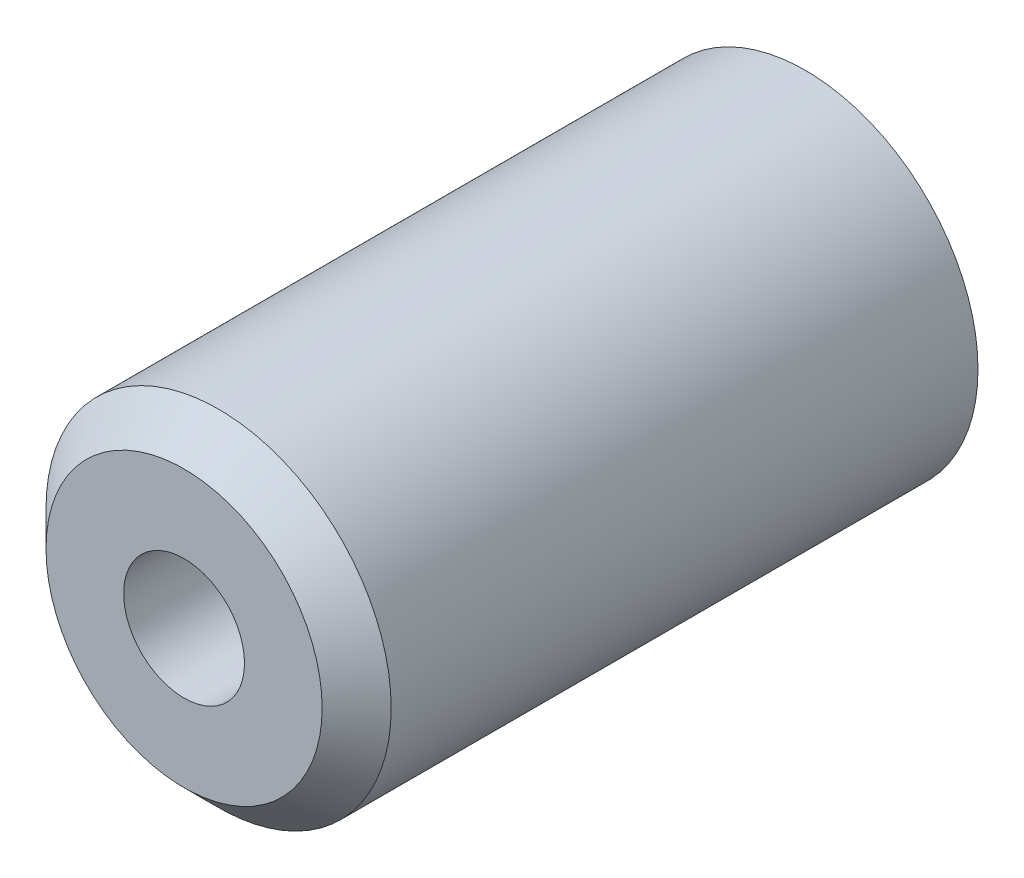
ISO-10303-21;
HEADER;
FILE_DESCRIPTION(('STEP AP214'),'2;1');
FILE_NAME('part.step','',(''),(''),'','','');
FILE_SCHEMA(('AUTOMOTIVE_DESIGN { 1 0 10303 214 1 1 1 1 }'));
ENDSEC;
DATA;
#1=APPLICATION_CONTEXT('core data for automotive mechanical design processes');
#2=APPLICATION_PROTOCOL_DEFINITION('international standard','automotive_design',2000,#1);
#3=PRODUCT_CONTEXT('',#1,'mechanical');
#4=PRODUCT('Part','Part','',(#3));
#5=PRODUCT_RELATED_PRODUCT_CATEGORY('part','',(#4));
#6=PRODUCT_DEFINITION_FORMATION('','',#4);
#7=PRODUCT_DEFINITION_CONTEXT('part definition',#1,'design');
#8=PRODUCT_DEFINITION('design','',#6,#7);
#9=PRODUCT_DEFINITION_SHAPE('','',#8);
#10=(LENGTH_UNIT() NAMED_UNIT(*) SI_UNIT(.MILLI.,.METRE.));
#11=(NAMED_UNIT(*) PLANE_ANGLE_UNIT() SI_UNIT($,.RADIAN.));
#12=(NAMED_UNIT(*) SI_UNIT($,.STERADIAN.) SOLID_ANGLE_UNIT());
#13=UNCERTAINTY_MEASURE_WITH_UNIT(LENGTH_MEASURE(1.E-05),#10,'distance_accuracy_value','');
#14=(GEOMETRIC_REPRESENTATION_CONTEXT(3) GLOBAL_UNCERTAINTY_ASSIGNED_CONTEXT((#13)) GLOBAL_UNIT_ASSIGNED_CONTEXT((#10,
#11,#12)) REPRESENTATION_CONTEXT('',''));
#15=CARTESIAN_POINT('',(0.,0.,0.));
#16=DIRECTION('',(0.,0.,1.));
#17=DIRECTION('',(1.,0.,0.));
#18=AXIS2_PLACEMENT_3D('',#15,#16,#17);
#19=CARTESIAN_POINT('',(0.,0.,18.));
#20=DIRECTION('',(0.,0.,1.));
#21=DIRECTION('',(1.,0.,0.));
#22=AXIS2_PLACEMENT_3D('',#19,#20,#21);
#23=PLANE('',#22);
#24=CARTESIAN_POINT('',(0.,0.,18.));
#25=DIRECTION('',(0.,0.,1.));
#26=DIRECTION('',(1.,0.,0.));
#27=AXIS2_PLACEMENT_3D('',#24,#25,#26);
#28=CIRCLE('',#27,4.);
#29=CARTESIAN_POINT('',(4.,0.,18.));
#30=VERTEX_POINT('',#29);
#31=EDGE_CURVE('E35',#30,#30,#28,.T.);
#32=ORIENTED_EDGE('',*,*,#31,.T.);
#33=EDGE_LOOP('',(#32));
#34=FACE_BOUND('',#33,.T.);
#35=CARTESIAN_POINT('',(0.,0.,18.));
#36=DIRECTION('',(0.,0.,1.));
#37=DIRECTION('',(1.,0.,0.));
#38=AXIS2_PLACEMENT_3D('',#35,#36,#37);
#39=CIRCLE('',#38,1.75);
#40=CARTESIAN_POINT('',(1.75,0.,18.));
#41=VERTEX_POINT('',#40);
#42=EDGE_CURVE('E43',#41,#41,#39,.T.);
#43=ORIENTED_EDGE('',*,*,#42,.F.);
#44=EDGE_LOOP('',(#43));
#45=FACE_BOUND('',#44,.T.);
#46=ADVANCED_FACE('F28',(#34,#45),#23,.T.);
#47=CARTESIAN_POINT('',(0.,0.,0.));
#48=DIRECTION('',(0.,0.,1.));
#49=DIRECTION('',(1.,0.,0.));
#50=AXIS2_PLACEMENT_3D('',#47,#48,#49);
#51=PLANE('',#50);
#52=CARTESIAN_POINT('',(0.,0.,0.));
#53=DIRECTION('',(0.,0.,1.));
#54=DIRECTION('',(1.,0.,0.));
#55=AXIS2_PLACEMENT_3D('',#52,#53,#54);
#56=CIRCLE('',#55,5.);
#57=CARTESIAN_POINT('',(5.,0.,0.));
#58=VERTEX_POINT('',#57);
#59=EDGE_CURVE('E39',#58,#58,#56,.T.);
#60=ORIENTED_EDGE('',*,*,#59,.F.);
#61=EDGE_LOOP('',(#60));
#62=FACE_BOUND('',#61,.T.);
#63=CARTESIAN_POINT('',(0.,0.,0.));
#64=DIRECTION('',(0.,0.,1.));
#65=DIRECTION('',(1.,0.,0.));
#66=AXIS2_PLACEMENT_3D('',#63,#64,#65);
#67=CIRCLE('',#66,1.75);
#68=CARTESIAN_POINT('',(1.75,0.,0.));
#69=VERTEX_POINT('',#68);
#70=EDGE_CURVE('E46',#69,#69,#67,.T.);
#71=ORIENTED_EDGE('',*,*,#70,.T.);
#72=EDGE_LOOP('',(#71));
#73=FACE_BOUND('',#72,.T.);
#74=ADVANCED_FACE('F56',(#62,#73),#51,.F.);
#75=CARTESIAN_POINT('',(0.,0.,18.));
#76=DIRECTION('',(0.,0.,-1.));
#77=DIRECTION('',(-1.,0.,0.));
#78=AXIS2_PLACEMENT_3D('',#75,#76,#77);
#79=CYLINDRICAL_SURFACE('',#78,5.);
#80=CARTESIAN_POINT('',(0.,0.,17.));
#81=DIRECTION('',(0.,0.,1.));
#82=DIRECTION('',(1.,0.,0.));
#83=AXIS2_PLACEMENT_3D('',#80,#81,#82);
#84=CIRCLE('',#83,5.);
#85=CARTESIAN_POINT('',(5.,0.,17.));
#86=VERTEX_POINT('',#85);
#87=EDGE_CURVE('E10',#86,#86,#84,.F.);
#88=ORIENTED_EDGE('',*,*,#87,.T.);
#89=EDGE_LOOP('',(#88));
#90=FACE_BOUND('',#89,.T.);
#91=ORIENTED_EDGE('',*,*,#59,.T.);
#92=EDGE_LOOP('',(#91));
#93=FACE_BOUND('',#92,.T.);
#94=ADVANCED_FACE('F61',(#90,#93),#79,.T.);
#95=CARTESIAN_POINT('',(0.,0.,18.));
#96=DIRECTION('',(0.,0.,-1.));
#97=DIRECTION('',(-1.,0.,0.));
#98=AXIS2_PLACEMENT_3D('',#95,#96,#97);
#99=CYLINDRICAL_SURFACE('',#98,1.75);
#100=ORIENTED_EDGE('',*,*,#42,.T.);
#101=EDGE_LOOP('',(#100));
#102=FACE_BOUND('',#101,.T.);
#103=ORIENTED_EDGE('',*,*,#70,.F.);
#104=EDGE_LOOP('',(#103));
#105=FACE_BOUND('',#104,.T.);
#106=ADVANCED_FACE('F52',(#102,#105),#99,.F.);
#107=CARTESIAN_POINT('',(0.,0.,18.));
#108=DIRECTION('',(0.,0.,-1.));
#109=DIRECTION('',(-1.,0.,0.));
#110=AXIS2_PLACEMENT_3D('',#107,#108,#109);
#111=CONICAL_SURFACE('',#110,4.,0.785398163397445);
#112=ORIENTED_EDGE('',*,*,#87,.F.);
#113=EDGE_LOOP('',(#112));
#114=FACE_BOUND('',#113,.T.);
#115=ORIENTED_EDGE('',*,*,#31,.F.);
#116=EDGE_LOOP('',(#115));
#117=FACE_BOUND('',#116,.T.);
#118=ADVANCED_FACE('F30',(#114,#117),#111,.T.);
#119=CLOSED_SHELL('',(#46,#74,#94,#106,#118));
#120=MANIFOLD_SOLID_BREP('B2',#119);
#121=ADVANCED_BREP_SHAPE_REPRESENTATION('',(#18,#120),#14);
#122=SHAPE_DEFINITION_REPRESENTATION(#9,#121);
ENDSEC;
END-ISO-10303-21;
